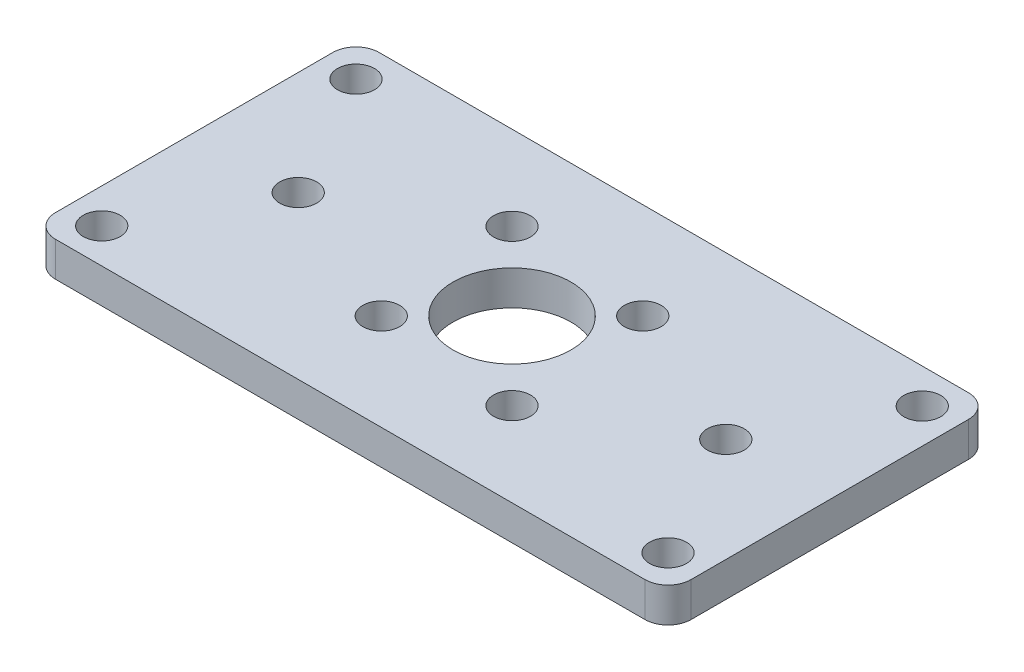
ISO-10303-21;
HEADER;
FILE_DESCRIPTION(('STEP AP214'),'2;1');
FILE_NAME('part.step','',(''),(''),'','','');
FILE_SCHEMA(('AUTOMOTIVE_DESIGN { 1 0 10303 214 1 1 1 1 }'));
ENDSEC;
DATA;
#1=APPLICATION_CONTEXT('core data for automotive mechanical design processes');
#2=APPLICATION_PROTOCOL_DEFINITION('international standard','automotive_design',2000,#1);
#3=PRODUCT_CONTEXT('',#1,'mechanical');
#4=PRODUCT('Part','Part','',(#3));
#5=PRODUCT_RELATED_PRODUCT_CATEGORY('part','',(#4));
#6=PRODUCT_DEFINITION_FORMATION('','',#4);
#7=PRODUCT_DEFINITION_CONTEXT('part definition',#1,'design');
#8=PRODUCT_DEFINITION('design','',#6,#7);
#9=PRODUCT_DEFINITION_SHAPE('','',#8);
#10=(LENGTH_UNIT() NAMED_UNIT(*) SI_UNIT(.MILLI.,.METRE.));
#11=(NAMED_UNIT(*) PLANE_ANGLE_UNIT() SI_UNIT($,.RADIAN.));
#12=(NAMED_UNIT(*) SI_UNIT($,.STERADIAN.) SOLID_ANGLE_UNIT());
#13=UNCERTAINTY_MEASURE_WITH_UNIT(LENGTH_MEASURE(1.E-05),#10,'distance_accuracy_value','');
#14=(GEOMETRIC_REPRESENTATION_CONTEXT(3) GLOBAL_UNCERTAINTY_ASSIGNED_CONTEXT((#13)) GLOBAL_UNIT_ASSIGNED_CONTEXT((#10,
#11,#12)) REPRESENTATION_CONTEXT('',''));
#15=CARTESIAN_POINT('',(0.,0.,0.));
#16=DIRECTION('',(0.,0.,1.));
#17=DIRECTION('',(1.,0.,0.));
#18=AXIS2_PLACEMENT_3D('',#15,#16,#17);
#19=CARTESIAN_POINT('',(0.,3.,0.));
#20=DIRECTION('',(0.,-1.,0.));
#21=DIRECTION('',(0.,0.,-1.));
#22=AXIS2_PLACEMENT_3D('',#19,#20,#21);
#23=PLANE('',#22);
#24=CARTESIAN_POINT('',(24.5,3.,11.));
#25=DIRECTION('',(0.,1.,0.));
#26=DIRECTION('',(0.,0.,-1.));
#27=AXIS2_PLACEMENT_3D('',#24,#25,#26);
#28=CIRCLE('',#27,1.6);
#29=CARTESIAN_POINT('',(24.5,3.,9.39999999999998));
#30=VERTEX_POINT('',#29);
#31=EDGE_CURVE('E262',#30,#30,#28,.T.);
#32=ORIENTED_EDGE('',*,*,#31,.F.);
#33=EDGE_LOOP('',(#32));
#34=FACE_BOUND('',#33,.T.);
#35=CARTESIAN_POINT('',(-24.5,3.,-11.));
#36=DIRECTION('',(0.,1.,0.));
#37=DIRECTION('',(0.,0.,1.));
#38=AXIS2_PLACEMENT_3D('',#35,#36,#37);
#39=CIRCLE('',#38,1.6);
#40=CARTESIAN_POINT('',(-24.5,3.,-9.40000000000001));
#41=VERTEX_POINT('',#40);
#42=EDGE_CURVE('E279',#41,#41,#39,.T.);
#43=ORIENTED_EDGE('',*,*,#42,.F.);
#44=EDGE_LOOP('',(#43));
#45=FACE_BOUND('',#44,.T.);
#46=CARTESIAN_POINT('',(-24.5,3.,11.));
#47=DIRECTION('',(0.,1.,0.));
#48=DIRECTION('',(0.,0.,1.));
#49=AXIS2_PLACEMENT_3D('',#46,#47,#48);
#50=CIRCLE('',#49,1.6);
#51=CARTESIAN_POINT('',(-24.5,3.,12.6));
#52=VERTEX_POINT('',#51);
#53=EDGE_CURVE('E270',#52,#52,#50,.T.);
#54=ORIENTED_EDGE('',*,*,#53,.F.);
#55=EDGE_LOOP('',(#54));
#56=FACE_BOUND('',#55,.T.);
#57=CARTESIAN_POINT('',(18.5,3.,0.));
#58=DIRECTION('',(0.,1.,0.));
#59=DIRECTION('',(0.,0.,1.));
#60=AXIS2_PLACEMENT_3D('',#57,#58,#59);
#61=CIRCLE('',#60,1.6);
#62=CARTESIAN_POINT('',(18.5,3.,1.59999999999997));
#63=VERTEX_POINT('',#62);
#64=EDGE_CURVE('E271',#63,#63,#61,.T.);
#65=ORIENTED_EDGE('',*,*,#64,.F.);
#66=EDGE_LOOP('',(#65));
#67=FACE_BOUND('',#66,.T.);
#68=CARTESIAN_POINT('',(-18.5,3.,0.));
#69=DIRECTION('',(0.,1.,0.));
#70=DIRECTION('',(0.,0.,-1.));
#71=AXIS2_PLACEMENT_3D('',#68,#69,#70);
#72=CIRCLE('',#71,1.6);
#73=CARTESIAN_POINT('',(-18.5,3.,-1.60000000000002));
#74=VERTEX_POINT('',#73);
#75=EDGE_CURVE('E294',#74,#74,#72,.T.);
#76=ORIENTED_EDGE('',*,*,#75,.F.);
#77=EDGE_LOOP('',(#76));
#78=FACE_BOUND('',#77,.T.);
#79=CARTESIAN_POINT('',(24.5,3.,-11.));
#80=DIRECTION('',(0.,1.,0.));
#81=DIRECTION('',(0.,0.,-1.));
#82=AXIS2_PLACEMENT_3D('',#79,#80,#81);
#83=CIRCLE('',#82,1.6);
#84=CARTESIAN_POINT('',(24.5,3.,-12.6));
#85=VERTEX_POINT('',#84);
#86=EDGE_CURVE('E258',#85,#85,#83,.T.);
#87=ORIENTED_EDGE('',*,*,#86,.F.);
#88=EDGE_LOOP('',(#87));
#89=FACE_BOUND('',#88,.T.);
#90=DIRECTION('',(1.,0.,0.));
#91=VECTOR('',#90,1.);
#92=CARTESIAN_POINT('',(-27.5,3.,14.));
#93=LINE('',#92,#91);
#94=CARTESIAN_POINT('',(-25.5,3.,14.));
#95=VERTEX_POINT('',#94);
#96=CARTESIAN_POINT('',(25.5,3.,14.));
#97=VERTEX_POINT('',#96);
#98=EDGE_CURVE('E156',#95,#97,#93,.T.);
#99=ORIENTED_EDGE('',*,*,#98,.T.);
#100=CARTESIAN_POINT('',(25.5,3.,12.));
#101=DIRECTION('',(0.,-1.,0.));
#102=DIRECTION('',(0.,0.,-1.));
#103=AXIS2_PLACEMENT_3D('',#100,#101,#102);
#104=CIRCLE('',#103,2.);
#105=CARTESIAN_POINT('',(27.5,3.,12.));
#106=VERTEX_POINT('',#105);
#107=EDGE_CURVE('E185',#97,#106,#104,.F.);
#108=ORIENTED_EDGE('',*,*,#107,.T.);
#109=DIRECTION('',(0.,0.,-1.));
#110=VECTOR('',#109,1.);
#111=CARTESIAN_POINT('',(27.5,3.,14.));
#112=LINE('',#111,#110);
#113=CARTESIAN_POINT('',(27.5,3.,-12.));
#114=VERTEX_POINT('',#113);
#115=EDGE_CURVE('E134',#106,#114,#112,.T.);
#116=ORIENTED_EDGE('',*,*,#115,.T.);
#117=CARTESIAN_POINT('',(25.5,3.,-12.));
#118=DIRECTION('',(0.,-1.,0.));
#119=DIRECTION('',(0.,0.,-1.));
#120=AXIS2_PLACEMENT_3D('',#117,#118,#119);
#121=CIRCLE('',#120,2.);
#122=CARTESIAN_POINT('',(25.5,3.,-14.));
#123=VERTEX_POINT('',#122);
#124=EDGE_CURVE('E179',#114,#123,#121,.F.);
#125=ORIENTED_EDGE('',*,*,#124,.T.);
#126=DIRECTION('',(-1.,0.,0.));
#127=VECTOR('',#126,1.);
#128=CARTESIAN_POINT('',(-27.5,3.,-14.));
#129=LINE('',#128,#127);
#130=CARTESIAN_POINT('',(-25.5,3.,-14.));
#131=VERTEX_POINT('',#130);
#132=EDGE_CURVE('E198',#123,#131,#129,.T.);
#133=ORIENTED_EDGE('',*,*,#132,.T.);
#134=CARTESIAN_POINT('',(-25.5,3.,-12.));
#135=DIRECTION('',(0.,-1.,0.));
#136=DIRECTION('',(0.,0.,-1.));
#137=AXIS2_PLACEMENT_3D('',#134,#135,#136);
#138=CIRCLE('',#137,2.);
#139=CARTESIAN_POINT('',(-27.5,3.,-12.));
#140=VERTEX_POINT('',#139);
#141=EDGE_CURVE('E68',#131,#140,#138,.F.);
#142=ORIENTED_EDGE('',*,*,#141,.T.);
#143=DIRECTION('',(0.,0.,1.));
#144=VECTOR('',#143,1.);
#145=CARTESIAN_POINT('',(-27.5,3.,14.));
#146=LINE('',#145,#144);
#147=CARTESIAN_POINT('',(-27.5,3.,12.));
#148=VERTEX_POINT('',#147);
#149=EDGE_CURVE('E205',#140,#148,#146,.T.);
#150=ORIENTED_EDGE('',*,*,#149,.T.);
#151=CARTESIAN_POINT('',(-25.5,3.,12.));
#152=DIRECTION('',(0.,-1.,0.));
#153=DIRECTION('',(0.,0.,-1.));
#154=AXIS2_PLACEMENT_3D('',#151,#152,#153);
#155=CIRCLE('',#154,2.);
#156=EDGE_CURVE('E182',#148,#95,#155,.F.);
#157=ORIENTED_EDGE('',*,*,#156,.T.);
#158=EDGE_LOOP('',(#99,#108,#116,#125,#133,#142,#150,#157));
#159=FACE_BOUND('',#158,.T.);
#160=CARTESIAN_POINT('',(0.,3.,0.));
#161=DIRECTION('',(0.,1.,0.));
#162=DIRECTION('',(0.,0.,1.));
#163=AXIS2_PLACEMENT_3D('',#160,#161,#162);
#164=CIRCLE('',#163,5.1);
#165=CARTESIAN_POINT('',(0.,3.,5.1));
#166=VERTEX_POINT('',#165);
#167=EDGE_CURVE('E145',#166,#166,#164,.T.);
#168=ORIENTED_EDGE('',*,*,#167,.F.);
#169=EDGE_LOOP('',(#168));
#170=FACE_BOUND('',#169,.T.);
#171=CARTESIAN_POINT('',(-5.65685424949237,3.,5.65685424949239));
#172=DIRECTION('',(0.,1.,0.));
#173=DIRECTION('',(0.,0.,1.));
#174=AXIS2_PLACEMENT_3D('',#171,#172,#173);
#175=CIRCLE('',#174,1.6);
#176=CARTESIAN_POINT('',(-5.65685424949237,3.,7.25685424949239));
#177=VERTEX_POINT('',#176);
#178=EDGE_CURVE('E224',#177,#177,#175,.T.);
#179=ORIENTED_EDGE('',*,*,#178,.F.);
#180=EDGE_LOOP('',(#179));
#181=FACE_BOUND('',#180,.T.);
#182=CARTESIAN_POINT('',(5.65685424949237,3.,-5.65685424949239));
#183=DIRECTION('',(0.,1.,0.));
#184=DIRECTION('',(0.,0.,1.));
#185=AXIS2_PLACEMENT_3D('',#182,#183,#184);
#186=CIRCLE('',#185,1.6);
#187=CARTESIAN_POINT('',(5.65685424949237,3.,-4.05685424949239));
#188=VERTEX_POINT('',#187);
#189=EDGE_CURVE('E230',#188,#188,#186,.T.);
#190=ORIENTED_EDGE('',*,*,#189,.F.);
#191=EDGE_LOOP('',(#190));
#192=FACE_BOUND('',#191,.T.);
#193=CARTESIAN_POINT('',(6.71751442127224,3.,6.71751442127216));
#194=DIRECTION('',(0.,1.,0.));
#195=DIRECTION('',(0.,0.,1.));
#196=AXIS2_PLACEMENT_3D('',#193,#194,#195);
#197=CIRCLE('',#196,1.6);
#198=CARTESIAN_POINT('',(6.71751442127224,3.,8.31751442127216));
#199=VERTEX_POINT('',#198);
#200=EDGE_CURVE('E238',#199,#199,#197,.T.);
#201=ORIENTED_EDGE('',*,*,#200,.F.);
#202=EDGE_LOOP('',(#201));
#203=FACE_BOUND('',#202,.T.);
#204=CARTESIAN_POINT('',(-6.71751442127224,3.,-6.71751442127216));
#205=DIRECTION('',(0.,1.,0.));
#206=DIRECTION('',(0.,0.,1.));
#207=AXIS2_PLACEMENT_3D('',#204,#205,#206);
#208=CIRCLE('',#207,1.6);
#209=CARTESIAN_POINT('',(-6.71751442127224,3.,-5.11751442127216));
#210=VERTEX_POINT('',#209);
#211=EDGE_CURVE('E246',#210,#210,#208,.T.);
#212=ORIENTED_EDGE('',*,*,#211,.F.);
#213=EDGE_LOOP('',(#212));
#214=FACE_BOUND('',#213,.T.);
#215=ADVANCED_FACE('F45',(#34,#45,#56,#67,#78,#89,#159,#170,#181,#192,#203,#214),#23,.F.);
#216=CARTESIAN_POINT('',(0.,0.,0.));
#217=DIRECTION('',(0.,-1.,0.));
#218=DIRECTION('',(0.,0.,-1.));
#219=AXIS2_PLACEMENT_3D('',#216,#217,#218);
#220=PLANE('',#219);
#221=CARTESIAN_POINT('',(24.5,0.,11.));
#222=DIRECTION('',(0.,1.,0.));
#223=DIRECTION('',(0.,0.,-1.));
#224=AXIS2_PLACEMENT_3D('',#221,#222,#223);
#225=CIRCLE('',#224,1.6);
#226=CARTESIAN_POINT('',(24.5,0.,9.39999999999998));
#227=VERTEX_POINT('',#226);
#228=EDGE_CURVE('E283',#227,#227,#225,.T.);
#229=ORIENTED_EDGE('',*,*,#228,.T.);
#230=EDGE_LOOP('',(#229));
#231=FACE_BOUND('',#230,.T.);
#232=CARTESIAN_POINT('',(-24.5,0.,-11.));
#233=DIRECTION('',(0.,1.,0.));
#234=DIRECTION('',(0.,0.,1.));
#235=AXIS2_PLACEMENT_3D('',#232,#233,#234);
#236=CIRCLE('',#235,1.6);
#237=CARTESIAN_POINT('',(-24.5,0.,-9.40000000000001));
#238=VERTEX_POINT('',#237);
#239=EDGE_CURVE('E275',#238,#238,#236,.T.);
#240=ORIENTED_EDGE('',*,*,#239,.T.);
#241=EDGE_LOOP('',(#240));
#242=FACE_BOUND('',#241,.T.);
#243=CARTESIAN_POINT('',(-24.5,0.,11.));
#244=DIRECTION('',(0.,1.,0.));
#245=DIRECTION('',(0.,0.,1.));
#246=AXIS2_PLACEMENT_3D('',#243,#244,#245);
#247=CIRCLE('',#246,1.6);
#248=CARTESIAN_POINT('',(-24.5,0.,12.6));
#249=VERTEX_POINT('',#248);
#250=EDGE_CURVE('E266',#249,#249,#247,.T.);
#251=ORIENTED_EDGE('',*,*,#250,.T.);
#252=EDGE_LOOP('',(#251));
#253=FACE_BOUND('',#252,.T.);
#254=CARTESIAN_POINT('',(18.5,0.,0.));
#255=DIRECTION('',(0.,1.,0.));
#256=DIRECTION('',(0.,0.,1.));
#257=AXIS2_PLACEMENT_3D('',#254,#255,#256);
#258=CIRCLE('',#257,1.6);
#259=CARTESIAN_POINT('',(18.5,0.,1.59999999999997));
#260=VERTEX_POINT('',#259);
#261=EDGE_CURVE('E298',#260,#260,#258,.T.);
#262=ORIENTED_EDGE('',*,*,#261,.T.);
#263=EDGE_LOOP('',(#262));
#264=FACE_BOUND('',#263,.T.);
#265=CARTESIAN_POINT('',(-18.5,0.,0.));
#266=DIRECTION('',(0.,1.,0.));
#267=DIRECTION('',(0.,0.,-1.));
#268=AXIS2_PLACEMENT_3D('',#265,#266,#267);
#269=CIRCLE('',#268,1.6);
#270=CARTESIAN_POINT('',(-18.5,0.,-1.60000000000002));
#271=VERTEX_POINT('',#270);
#272=EDGE_CURVE('E290',#271,#271,#269,.T.);
#273=ORIENTED_EDGE('',*,*,#272,.T.);
#274=EDGE_LOOP('',(#273));
#275=FACE_BOUND('',#274,.T.);
#276=CARTESIAN_POINT('',(24.5,0.,-11.));
#277=DIRECTION('',(0.,1.,0.));
#278=DIRECTION('',(0.,0.,-1.));
#279=AXIS2_PLACEMENT_3D('',#276,#277,#278);
#280=CIRCLE('',#279,1.6);
#281=CARTESIAN_POINT('',(24.5,0.,-12.6));
#282=VERTEX_POINT('',#281);
#283=EDGE_CURVE('E254',#282,#282,#280,.T.);
#284=ORIENTED_EDGE('',*,*,#283,.T.);
#285=EDGE_LOOP('',(#284));
#286=FACE_BOUND('',#285,.T.);
#287=CARTESIAN_POINT('',(6.71751442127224,0.,6.71751442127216));
#288=DIRECTION('',(0.,1.,0.));
#289=DIRECTION('',(0.,0.,1.));
#290=AXIS2_PLACEMENT_3D('',#287,#288,#289);
#291=CIRCLE('',#290,1.6);
#292=CARTESIAN_POINT('',(6.71751442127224,0.,8.31751442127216));
#293=VERTEX_POINT('',#292);
#294=EDGE_CURVE('E242',#293,#293,#291,.T.);
#295=ORIENTED_EDGE('',*,*,#294,.T.);
#296=EDGE_LOOP('',(#295));
#297=FACE_BOUND('',#296,.T.);
#298=CARTESIAN_POINT('',(-5.65685424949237,0.,5.65685424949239));
#299=DIRECTION('',(0.,1.,0.));
#300=DIRECTION('',(0.,0.,1.));
#301=AXIS2_PLACEMENT_3D('',#298,#299,#300);
#302=CIRCLE('',#301,1.6);
#303=CARTESIAN_POINT('',(-5.65685424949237,0.,7.25685424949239));
#304=VERTEX_POINT('',#303);
#305=EDGE_CURVE('E226',#304,#304,#302,.T.);
#306=ORIENTED_EDGE('',*,*,#305,.T.);
#307=EDGE_LOOP('',(#306));
#308=FACE_BOUND('',#307,.T.);
#309=DIRECTION('',(0.,0.,-1.));
#310=VECTOR('',#309,1.);
#311=CARTESIAN_POINT('',(27.5,0.,14.));
#312=LINE('',#311,#310);
#313=CARTESIAN_POINT('',(27.5,0.,12.));
#314=VERTEX_POINT('',#313);
#315=CARTESIAN_POINT('',(27.5,0.,-12.));
#316=VERTEX_POINT('',#315);
#317=EDGE_CURVE('E131',#314,#316,#312,.T.);
#318=ORIENTED_EDGE('',*,*,#317,.F.);
#319=CARTESIAN_POINT('',(25.5,0.,12.));
#320=DIRECTION('',(0.,-1.,0.));
#321=DIRECTION('',(0.,0.,-1.));
#322=AXIS2_PLACEMENT_3D('',#319,#320,#321);
#323=CIRCLE('',#322,2.);
#324=CARTESIAN_POINT('',(25.5,0.,14.));
#325=VERTEX_POINT('',#324);
#326=EDGE_CURVE('E113',#314,#325,#323,.T.);
#327=ORIENTED_EDGE('',*,*,#326,.T.);
#328=DIRECTION('',(1.,0.,0.));
#329=VECTOR('',#328,1.);
#330=CARTESIAN_POINT('',(-27.5,0.,14.));
#331=LINE('',#330,#329);
#332=CARTESIAN_POINT('',(-25.5,0.,14.));
#333=VERTEX_POINT('',#332);
#334=EDGE_CURVE('E161',#333,#325,#331,.T.);
#335=ORIENTED_EDGE('',*,*,#334,.F.);
#336=CARTESIAN_POINT('',(-25.5,0.,12.));
#337=DIRECTION('',(0.,-1.,0.));
#338=DIRECTION('',(0.,0.,-1.));
#339=AXIS2_PLACEMENT_3D('',#336,#337,#338);
#340=CIRCLE('',#339,2.);
#341=CARTESIAN_POINT('',(-27.5,0.,12.));
#342=VERTEX_POINT('',#341);
#343=EDGE_CURVE('E125',#333,#342,#340,.T.);
#344=ORIENTED_EDGE('',*,*,#343,.T.);
#345=DIRECTION('',(0.,0.,1.));
#346=VECTOR('',#345,1.);
#347=CARTESIAN_POINT('',(-27.5,0.,14.));
#348=LINE('',#347,#346);
#349=CARTESIAN_POINT('',(-27.5,0.,-12.));
#350=VERTEX_POINT('',#349);
#351=EDGE_CURVE('E150',#350,#342,#348,.T.);
#352=ORIENTED_EDGE('',*,*,#351,.F.);
#353=CARTESIAN_POINT('',(-25.5,0.,-12.));
#354=DIRECTION('',(0.,-1.,0.));
#355=DIRECTION('',(0.,0.,-1.));
#356=AXIS2_PLACEMENT_3D('',#353,#354,#355);
#357=CIRCLE('',#356,2.);
#358=CARTESIAN_POINT('',(-25.5,0.,-14.));
#359=VERTEX_POINT('',#358);
#360=EDGE_CURVE('E136',#350,#359,#357,.T.);
#361=ORIENTED_EDGE('',*,*,#360,.T.);
#362=DIRECTION('',(-1.,0.,0.));
#363=VECTOR('',#362,1.);
#364=CARTESIAN_POINT('',(-27.5,0.,-14.));
#365=LINE('',#364,#363);
#366=CARTESIAN_POINT('',(25.5,0.,-14.));
#367=VERTEX_POINT('',#366);
#368=EDGE_CURVE('E144',#367,#359,#365,.T.);
#369=ORIENTED_EDGE('',*,*,#368,.F.);
#370=CARTESIAN_POINT('',(25.5,0.,-12.));
#371=DIRECTION('',(0.,-1.,0.));
#372=DIRECTION('',(0.,0.,-1.));
#373=AXIS2_PLACEMENT_3D('',#370,#371,#372);
#374=CIRCLE('',#373,2.);
#375=EDGE_CURVE('E142',#367,#316,#374,.T.);
#376=ORIENTED_EDGE('',*,*,#375,.T.);
#377=EDGE_LOOP('',(#318,#327,#335,#344,#352,#361,#369,#376));
#378=FACE_BOUND('',#377,.T.);
#379=CARTESIAN_POINT('',(0.,0.,0.));
#380=DIRECTION('',(0.,1.,0.));
#381=DIRECTION('',(0.,0.,1.));
#382=AXIS2_PLACEMENT_3D('',#379,#380,#381);
#383=CIRCLE('',#382,5.1);
#384=CARTESIAN_POINT('',(0.,0.,5.1));
#385=VERTEX_POINT('',#384);
#386=EDGE_CURVE('E153',#385,#385,#383,.T.);
#387=ORIENTED_EDGE('',*,*,#386,.T.);
#388=EDGE_LOOP('',(#387));
#389=FACE_BOUND('',#388,.T.);
#390=CARTESIAN_POINT('',(5.65685424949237,0.,-5.65685424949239));
#391=DIRECTION('',(0.,1.,0.));
#392=DIRECTION('',(0.,0.,1.));
#393=AXIS2_PLACEMENT_3D('',#390,#391,#392);
#394=CIRCLE('',#393,1.6);
#395=CARTESIAN_POINT('',(5.65685424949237,0.,-4.05685424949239));
#396=VERTEX_POINT('',#395);
#397=EDGE_CURVE('E234',#396,#396,#394,.T.);
#398=ORIENTED_EDGE('',*,*,#397,.T.);
#399=EDGE_LOOP('',(#398));
#400=FACE_BOUND('',#399,.T.);
#401=CARTESIAN_POINT('',(-6.71751442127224,0.,-6.71751442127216));
#402=DIRECTION('',(0.,1.,0.));
#403=DIRECTION('',(0.,0.,1.));
#404=AXIS2_PLACEMENT_3D('',#401,#402,#403);
#405=CIRCLE('',#404,1.6);
#406=CARTESIAN_POINT('',(-6.71751442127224,0.,-5.11751442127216));
#407=VERTEX_POINT('',#406);
#408=EDGE_CURVE('E250',#407,#407,#405,.T.);
#409=ORIENTED_EDGE('',*,*,#408,.T.);
#410=EDGE_LOOP('',(#409));
#411=FACE_BOUND('',#410,.T.);
#412=ADVANCED_FACE('F139',(#231,#242,#253,#264,#275,#286,#297,#308,#378,#389,#400,#411),#220,.T.);
#413=CARTESIAN_POINT('',(27.5,3.,14.));
#414=DIRECTION('',(-1.,0.,0.));
#415=DIRECTION('',(0.,0.,1.));
#416=AXIS2_PLACEMENT_3D('',#413,#414,#415);
#417=PLANE('',#416);
#418=ORIENTED_EDGE('',*,*,#115,.F.);
#419=DIRECTION('',(0.,-1.,0.));
#420=VECTOR('',#419,1.);
#421=CARTESIAN_POINT('',(27.5,3.,12.));
#422=LINE('',#421,#420);
#423=EDGE_CURVE('E117',#106,#314,#422,.T.);
#424=ORIENTED_EDGE('',*,*,#423,.T.);
#425=ORIENTED_EDGE('',*,*,#317,.T.);
#426=DIRECTION('',(0.,-1.,0.));
#427=VECTOR('',#426,1.);
#428=CARTESIAN_POINT('',(27.5,3.,-12.));
#429=LINE('',#428,#427);
#430=EDGE_CURVE('E137',#316,#114,#429,.F.);
#431=ORIENTED_EDGE('',*,*,#430,.T.);
#432=EDGE_LOOP('',(#418,#424,#425,#431));
#433=FACE_BOUND('',#432,.T.);
#434=ADVANCED_FACE('F130',(#433),#417,.F.);
#435=CARTESIAN_POINT('',(-27.5,3.,-14.));
#436=DIRECTION('',(0.,0.,1.));
#437=DIRECTION('',(1.,0.,0.));
#438=AXIS2_PLACEMENT_3D('',#435,#436,#437);
#439=PLANE('',#438);
#440=ORIENTED_EDGE('',*,*,#132,.F.);
#441=DIRECTION('',(0.,-1.,0.));
#442=VECTOR('',#441,1.);
#443=CARTESIAN_POINT('',(25.5,3.,-14.));
#444=LINE('',#443,#442);
#445=EDGE_CURVE('E11',#123,#367,#444,.T.);
#446=ORIENTED_EDGE('',*,*,#445,.T.);
#447=ORIENTED_EDGE('',*,*,#368,.T.);
#448=DIRECTION('',(0.,-1.,0.));
#449=VECTOR('',#448,1.);
#450=CARTESIAN_POINT('',(-25.5,3.,-14.));
#451=LINE('',#450,#449);
#452=EDGE_CURVE('E54',#359,#131,#451,.F.);
#453=ORIENTED_EDGE('',*,*,#452,.T.);
#454=EDGE_LOOP('',(#440,#446,#447,#453));
#455=FACE_BOUND('',#454,.T.);
#456=ADVANCED_FACE('F197',(#455),#439,.F.);
#457=CARTESIAN_POINT('',(-27.5,3.,14.));
#458=DIRECTION('',(1.,0.,0.));
#459=DIRECTION('',(0.,0.,-1.));
#460=AXIS2_PLACEMENT_3D('',#457,#458,#459);
#461=PLANE('',#460);
#462=ORIENTED_EDGE('',*,*,#351,.T.);
#463=DIRECTION('',(0.,-1.,0.));
#464=VECTOR('',#463,1.);
#465=CARTESIAN_POINT('',(-27.5,3.,12.));
#466=LINE('',#465,#464);
#467=EDGE_CURVE('E61',#342,#148,#466,.F.);
#468=ORIENTED_EDGE('',*,*,#467,.T.);
#469=ORIENTED_EDGE('',*,*,#149,.F.);
#470=DIRECTION('',(0.,-1.,0.));
#471=VECTOR('',#470,1.);
#472=CARTESIAN_POINT('',(-27.5,3.,-12.));
#473=LINE('',#472,#471);
#474=EDGE_CURVE('E188',#140,#350,#473,.T.);
#475=ORIENTED_EDGE('',*,*,#474,.T.);
#476=EDGE_LOOP('',(#462,#468,#469,#475));
#477=FACE_BOUND('',#476,.T.);
#478=ADVANCED_FACE('F209',(#477),#461,.F.);
#479=CARTESIAN_POINT('',(-27.5,3.,14.));
#480=DIRECTION('',(0.,0.,-1.));
#481=DIRECTION('',(-1.,0.,0.));
#482=AXIS2_PLACEMENT_3D('',#479,#480,#481);
#483=PLANE('',#482);
#484=ORIENTED_EDGE('',*,*,#334,.T.);
#485=DIRECTION('',(0.,-1.,0.));
#486=VECTOR('',#485,1.);
#487=CARTESIAN_POINT('',(25.5,3.,14.));
#488=LINE('',#487,#486);
#489=EDGE_CURVE('E118',#325,#97,#488,.F.);
#490=ORIENTED_EDGE('',*,*,#489,.T.);
#491=ORIENTED_EDGE('',*,*,#98,.F.);
#492=DIRECTION('',(0.,-1.,0.));
#493=VECTOR('',#492,1.);
#494=CARTESIAN_POINT('',(-25.5,3.,14.));
#495=LINE('',#494,#493);
#496=EDGE_CURVE('E124',#95,#333,#495,.T.);
#497=ORIENTED_EDGE('',*,*,#496,.T.);
#498=EDGE_LOOP('',(#484,#490,#491,#497));
#499=FACE_BOUND('',#498,.T.);
#500=ADVANCED_FACE('F216',(#499),#483,.F.);
#501=CARTESIAN_POINT('',(0.,3.,0.));
#502=DIRECTION('',(0.,-1.,0.));
#503=DIRECTION('',(0.,0.,-1.));
#504=AXIS2_PLACEMENT_3D('',#501,#502,#503);
#505=CYLINDRICAL_SURFACE('',#504,5.1);
#506=ORIENTED_EDGE('',*,*,#167,.T.);
#507=EDGE_LOOP('',(#506));
#508=FACE_BOUND('',#507,.T.);
#509=ORIENTED_EDGE('',*,*,#386,.F.);
#510=EDGE_LOOP('',(#509));
#511=FACE_BOUND('',#510,.T.);
#512=ADVANCED_FACE('F346',(#508,#511),#505,.F.);
#513=CARTESIAN_POINT('',(-5.65685424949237,3.,5.65685424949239));
#514=DIRECTION('',(0.,-1.,0.));
#515=DIRECTION('',(0.,0.,-1.));
#516=AXIS2_PLACEMENT_3D('',#513,#514,#515);
#517=CYLINDRICAL_SURFACE('',#516,1.6);
#518=ORIENTED_EDGE('',*,*,#178,.T.);
#519=EDGE_LOOP('',(#518));
#520=FACE_BOUND('',#519,.T.);
#521=ORIENTED_EDGE('',*,*,#305,.F.);
#522=EDGE_LOOP('',(#521));
#523=FACE_BOUND('',#522,.T.);
#524=ADVANCED_FACE('F342',(#520,#523),#517,.F.);
#525=CARTESIAN_POINT('',(5.65685424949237,3.,-5.65685424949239));
#526=DIRECTION('',(0.,-1.,0.));
#527=DIRECTION('',(0.,0.,-1.));
#528=AXIS2_PLACEMENT_3D('',#525,#526,#527);
#529=CYLINDRICAL_SURFACE('',#528,1.6);
#530=ORIENTED_EDGE('',*,*,#189,.T.);
#531=EDGE_LOOP('',(#530));
#532=FACE_BOUND('',#531,.T.);
#533=ORIENTED_EDGE('',*,*,#397,.F.);
#534=EDGE_LOOP('',(#533));
#535=FACE_BOUND('',#534,.T.);
#536=ADVANCED_FACE('F338',(#532,#535),#529,.F.);
#537=CARTESIAN_POINT('',(6.71751442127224,3.,6.71751442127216));
#538=DIRECTION('',(0.,-1.,0.));
#539=DIRECTION('',(0.,0.,-1.));
#540=AXIS2_PLACEMENT_3D('',#537,#538,#539);
#541=CYLINDRICAL_SURFACE('',#540,1.6);
#542=ORIENTED_EDGE('',*,*,#200,.T.);
#543=EDGE_LOOP('',(#542));
#544=FACE_BOUND('',#543,.T.);
#545=ORIENTED_EDGE('',*,*,#294,.F.);
#546=EDGE_LOOP('',(#545));
#547=FACE_BOUND('',#546,.T.);
#548=ADVANCED_FACE('F328',(#544,#547),#541,.F.);
#549=CARTESIAN_POINT('',(-6.71751442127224,3.,-6.71751442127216));
#550=DIRECTION('',(0.,-1.,0.));
#551=DIRECTION('',(0.,0.,-1.));
#552=AXIS2_PLACEMENT_3D('',#549,#550,#551);
#553=CYLINDRICAL_SURFACE('',#552,1.6);
#554=ORIENTED_EDGE('',*,*,#211,.T.);
#555=EDGE_LOOP('',(#554));
#556=FACE_BOUND('',#555,.T.);
#557=ORIENTED_EDGE('',*,*,#408,.F.);
#558=EDGE_LOOP('',(#557));
#559=FACE_BOUND('',#558,.T.);
#560=ADVANCED_FACE('F319',(#556,#559),#553,.F.);
#561=CARTESIAN_POINT('',(24.5,0.,-11.));
#562=DIRECTION('',(0.,1.,0.));
#563=DIRECTION('',(0.,0.,1.));
#564=AXIS2_PLACEMENT_3D('',#561,#562,#563);
#565=CYLINDRICAL_SURFACE('',#564,1.6);
#566=ORIENTED_EDGE('',*,*,#283,.F.);
#567=EDGE_LOOP('',(#566));
#568=FACE_BOUND('',#567,.T.);
#569=ORIENTED_EDGE('',*,*,#86,.T.);
#570=EDGE_LOOP('',(#569));
#571=FACE_BOUND('',#570,.T.);
#572=ADVANCED_FACE('F316',(#568,#571),#565,.F.);
#573=CARTESIAN_POINT('',(-18.5,0.,0.));
#574=DIRECTION('',(0.,1.,0.));
#575=DIRECTION('',(0.,0.,1.));
#576=AXIS2_PLACEMENT_3D('',#573,#574,#575);
#577=CYLINDRICAL_SURFACE('',#576,1.6);
#578=ORIENTED_EDGE('',*,*,#272,.F.);
#579=EDGE_LOOP('',(#578));
#580=FACE_BOUND('',#579,.T.);
#581=ORIENTED_EDGE('',*,*,#75,.T.);
#582=EDGE_LOOP('',(#581));
#583=FACE_BOUND('',#582,.T.);
#584=ADVANCED_FACE('F318',(#580,#583),#577,.F.);
#585=CARTESIAN_POINT('',(18.5,0.,0.));
#586=DIRECTION('',(0.,1.,0.));
#587=DIRECTION('',(0.,0.,1.));
#588=AXIS2_PLACEMENT_3D('',#585,#586,#587);
#589=CYLINDRICAL_SURFACE('',#588,1.6);
#590=ORIENTED_EDGE('',*,*,#261,.F.);
#591=EDGE_LOOP('',(#590));
#592=FACE_BOUND('',#591,.T.);
#593=ORIENTED_EDGE('',*,*,#64,.T.);
#594=EDGE_LOOP('',(#593));
#595=FACE_BOUND('',#594,.T.);
#596=ADVANCED_FACE('F306',(#592,#595),#589,.F.);
#597=CARTESIAN_POINT('',(-24.5,0.,11.));
#598=DIRECTION('',(0.,1.,0.));
#599=DIRECTION('',(0.,0.,1.));
#600=AXIS2_PLACEMENT_3D('',#597,#598,#599);
#601=CYLINDRICAL_SURFACE('',#600,1.6);
#602=ORIENTED_EDGE('',*,*,#250,.F.);
#603=EDGE_LOOP('',(#602));
#604=FACE_BOUND('',#603,.T.);
#605=ORIENTED_EDGE('',*,*,#53,.T.);
#606=EDGE_LOOP('',(#605));
#607=FACE_BOUND('',#606,.T.);
#608=ADVANCED_FACE('F333',(#604,#607),#601,.F.);
#609=CARTESIAN_POINT('',(-24.5,0.,-11.));
#610=DIRECTION('',(0.,1.,0.));
#611=DIRECTION('',(0.,0.,1.));
#612=AXIS2_PLACEMENT_3D('',#609,#610,#611);
#613=CYLINDRICAL_SURFACE('',#612,1.6);
#614=ORIENTED_EDGE('',*,*,#239,.F.);
#615=EDGE_LOOP('',(#614));
#616=FACE_BOUND('',#615,.T.);
#617=ORIENTED_EDGE('',*,*,#42,.T.);
#618=EDGE_LOOP('',(#617));
#619=FACE_BOUND('',#618,.T.);
#620=ADVANCED_FACE('F446',(#616,#619),#613,.F.);
#621=CARTESIAN_POINT('',(24.5,0.,11.));
#622=DIRECTION('',(0.,1.,0.));
#623=DIRECTION('',(0.,0.,1.));
#624=AXIS2_PLACEMENT_3D('',#621,#622,#623);
#625=CYLINDRICAL_SURFACE('',#624,1.6);
#626=ORIENTED_EDGE('',*,*,#228,.F.);
#627=EDGE_LOOP('',(#626));
#628=FACE_BOUND('',#627,.T.);
#629=ORIENTED_EDGE('',*,*,#31,.T.);
#630=EDGE_LOOP('',(#629));
#631=FACE_BOUND('',#630,.T.);
#632=ADVANCED_FACE('F364',(#628,#631),#625,.F.);
#633=CARTESIAN_POINT('',(25.5,3.,12.));
#634=DIRECTION('',(0.,-1.,0.));
#635=DIRECTION('',(0.,0.,-1.));
#636=AXIS2_PLACEMENT_3D('',#633,#634,#635);
#637=CYLINDRICAL_SURFACE('',#636,2.);
#638=ORIENTED_EDGE('',*,*,#107,.F.);
#639=ORIENTED_EDGE('',*,*,#489,.F.);
#640=ORIENTED_EDGE('',*,*,#326,.F.);
#641=ORIENTED_EDGE('',*,*,#423,.F.);
#642=EDGE_LOOP('',(#638,#639,#640,#641));
#643=FACE_BOUND('',#642,.T.);
#644=ADVANCED_FACE('F116',(#643),#637,.T.);
#645=CARTESIAN_POINT('',(-25.5,3.,12.));
#646=DIRECTION('',(0.,-1.,0.));
#647=DIRECTION('',(0.,0.,-1.));
#648=AXIS2_PLACEMENT_3D('',#645,#646,#647);
#649=CYLINDRICAL_SURFACE('',#648,2.);
#650=ORIENTED_EDGE('',*,*,#156,.F.);
#651=ORIENTED_EDGE('',*,*,#467,.F.);
#652=ORIENTED_EDGE('',*,*,#343,.F.);
#653=ORIENTED_EDGE('',*,*,#496,.F.);
#654=EDGE_LOOP('',(#650,#651,#652,#653));
#655=FACE_BOUND('',#654,.T.);
#656=ADVANCED_FACE('F213',(#655),#649,.T.);
#657=CARTESIAN_POINT('',(25.5,3.,-12.));
#658=DIRECTION('',(0.,-1.,0.));
#659=DIRECTION('',(0.,0.,-1.));
#660=AXIS2_PLACEMENT_3D('',#657,#658,#659);
#661=CYLINDRICAL_SURFACE('',#660,2.);
#662=ORIENTED_EDGE('',*,*,#124,.F.);
#663=ORIENTED_EDGE('',*,*,#430,.F.);
#664=ORIENTED_EDGE('',*,*,#375,.F.);
#665=ORIENTED_EDGE('',*,*,#445,.F.);
#666=EDGE_LOOP('',(#662,#663,#664,#665));
#667=FACE_BOUND('',#666,.T.);
#668=ADVANCED_FACE('F366',(#667),#661,.T.);
#669=CARTESIAN_POINT('',(-25.5,3.,-12.));
#670=DIRECTION('',(0.,-1.,0.));
#671=DIRECTION('',(0.,0.,-1.));
#672=AXIS2_PLACEMENT_3D('',#669,#670,#671);
#673=CYLINDRICAL_SURFACE('',#672,2.);
#674=ORIENTED_EDGE('',*,*,#141,.F.);
#675=ORIENTED_EDGE('',*,*,#452,.F.);
#676=ORIENTED_EDGE('',*,*,#360,.F.);
#677=ORIENTED_EDGE('',*,*,#474,.F.);
#678=EDGE_LOOP('',(#674,#675,#676,#677));
#679=FACE_BOUND('',#678,.T.);
#680=ADVANCED_FACE('F47',(#679),#673,.T.);
#681=CLOSED_SHELL('',(#215,#412,#434,#456,#478,#500,#512,#524,#536,#548,#560,#572,#584,#596,
#608,#620,#632,#644,#656,#668,#680));
#682=MANIFOLD_SOLID_BREP('B2',#681);
#683=ADVANCED_BREP_SHAPE_REPRESENTATION('',(#18,#682),#14);
#684=SHAPE_DEFINITION_REPRESENTATION(#9,#683);
ENDSEC;
END-ISO-10303-21;
